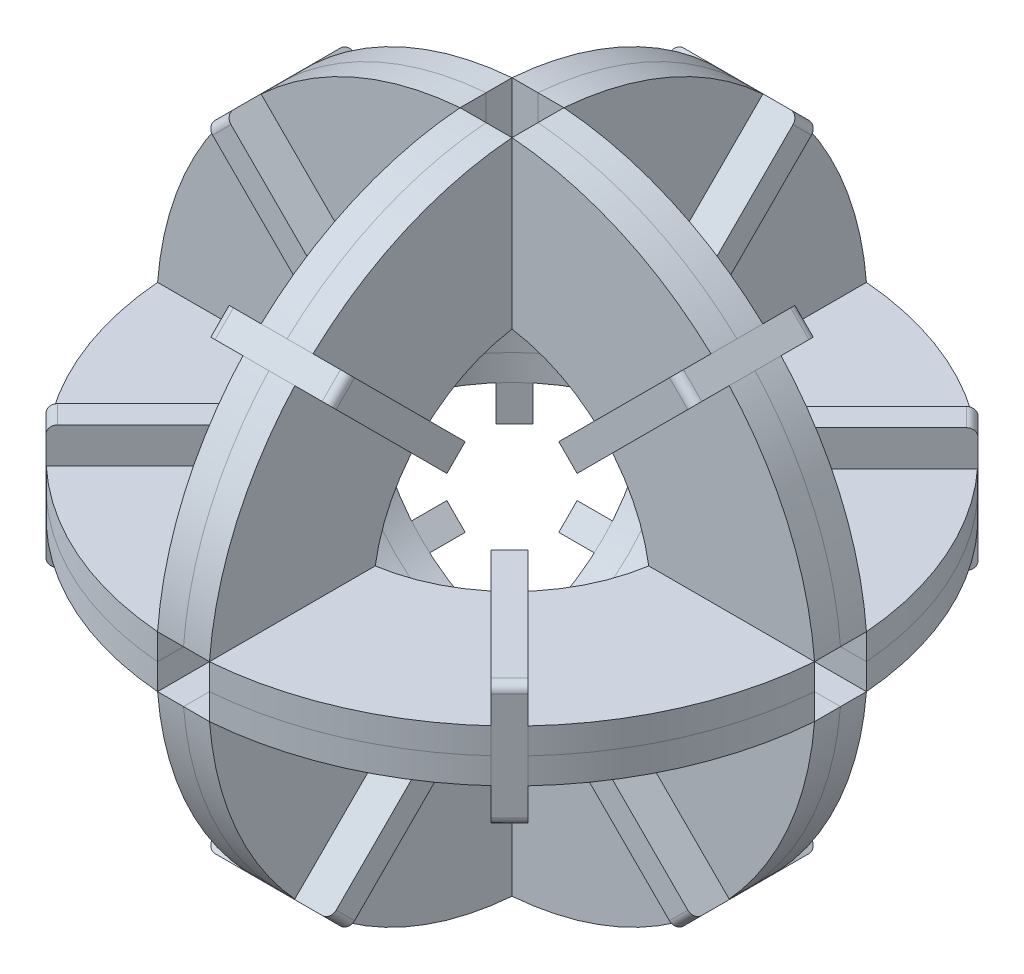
from build123d import *

# Parameters (mm, degrees)
BOSS_EXTRUDE2_DEPTH = 4.000000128
BOSS_EXTRUDE3_DEPTH = 4.000000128
BOSS_EXTRUDE1_DEPTH = 4.000000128
CUT_EXTRUDE1_DEPTH  = 86.468016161
CUT_EXTRUDE2_DEPTH  = 86.468016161
CUT_EXTRUDE3_DEPTH  = 86.468016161
CIRPATTERN2_COUNT   = 4
BOSS_EXTRUDE4_DEPTH = 4.000000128
BOSS_EXTRUDE5_DEPTH = 4.000000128
FILLET1_R           = 1.27
FILLET2_R           = 1.27
CIRPATTERN3_COUNT   = 4
FILLET3_R           = 1.27


with BuildPart() as part:
    # Sketch6 → Boss-Extrude2 (new body)
    with BuildSketch(Plane(origin=(0, 0, 0), x_dir=(0, 0, -1), z_dir=(1, 0, 0))):
        with BuildLine():
            Line((-4.000000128, 50.64227482), (-4.000000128, 25.083061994))
            ThreePointArc((-4.000000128, 25.083061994), (-17.960512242, 17.960512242), (-25.083061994, 4.000000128))
            Line((-25.083061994, 4.000000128), (-50.64227482, 4.000000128))
            ThreePointArc((-50.64227482, 4.000000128), (-35.921024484, 35.921024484), (-4.000000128, 50.64227482))
        make_face()
    extrude(amount=BOSS_EXTRUDE2_DEPTH)

    # Sketch8 → Cut-Extrude1 (cut, through all)
    with BuildSketch(Plane(origin=(4.000000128, 0, 0), x_dir=(0, 0, -1), z_dir=(1, 0, 0))):
        Polygon((-37.144319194, 34.697729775), (-34.697729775, 37.144319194), (-25.717473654, 28.164063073), (-28.164063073, 25.717473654), align=None)
    extrude(amount=-CUT_EXTRUDE1_DEPTH, mode=Mode.SUBTRACT)


with BuildPart() as body_2:
    # Sketch7 → Boss-Extrude3 (new body)
    with BuildSketch(Plane(origin=(0, 0, 0), x_dir=(1, 0, 0), z_dir=(0, 1, 0))):
        with BuildLine():
            Line((4.000000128, -25.083061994), (4.000000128, -50.64227482))
            ThreePointArc((4.000000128, -50.64227482), (35.921024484, -35.921024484), (50.64227482, -4.000000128))
            Line((50.64227482, -4.000000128), (25.083061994, -4.000000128))
            ThreePointArc((25.083061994, -4.000000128), (17.960512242, -17.960512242), (4.000000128, -25.083061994))
        make_face()
    extrude(amount=BOSS_EXTRUDE3_DEPTH)

    # Sketch10 → Cut-Extrude3 (cut, through all)
    with BuildSketch(Plane(origin=(0, 4.000000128, 0), x_dir=(1, 0, 0), z_dir=(0, 1, 0))):
        Polygon((37.144319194, -34.697729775), (34.697729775, -37.144319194), (25.717473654, -28.164063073), (28.164063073, -25.717473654), align=None)
    extrude(amount=-CUT_EXTRUDE3_DEPTH, mode=Mode.SUBTRACT)


with BuildPart() as body_3:
    # Sketch5 → Boss-Extrude1 (new body)
    with BuildSketch(Plane.XY):
        with BuildLine():
            Line((4.000000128, 50.64227482), (4.000000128, 25.083061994))
            ThreePointArc((4.000000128, 25.083061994), (17.960512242, 17.960512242), (25.083061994, 4.000000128))
            Line((25.083061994, 4.000000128), (50.64227482, 4.000000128))
            ThreePointArc((50.64227482, 4.000000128), (35.921024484, 35.921024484), (4.000000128, 50.64227482))
        make_face()
    extrude(amount=BOSS_EXTRUDE1_DEPTH)

    # Sketch9 → Cut-Extrude2 (cut, through all)
    with BuildSketch(Plane.XY.offset(4.000000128)):
        Polygon((34.697729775, 37.144319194), (37.144319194, 34.697729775), (28.164063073, 25.717473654), (25.717473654, 28.164063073), align=None)
    extrude(amount=-CUT_EXTRUDE2_DEPTH, mode=Mode.SUBTRACT)


with BuildPart() as cirpattern2_1:
    # CirPattern2: pattern copy
    add(body_2.part.rotate(Axis((0, 0, 0), (0, 1, 0)), 1 * 360 / CIRPATTERN2_COUNT))


with BuildPart() as cirpattern2_2:
    # CirPattern2: pattern copy
    add(body_2.part.rotate(Axis((0, 0, 0), (0, 1, 0)), 2 * 360 / CIRPATTERN2_COUNT))


with BuildPart() as cirpattern2_3:
    # CirPattern2: pattern copy
    add(body_2.part.rotate(Axis((0, 0, 0), (0, 1, 0)), 3 * 360 / CIRPATTERN2_COUNT))


with BuildPart() as cirpattern2_4:
    # CirPattern2: pattern copy
    add(body_3.part.rotate(Axis((0, 0, 0), (0, 1, 0)), 1 * 360 / CIRPATTERN2_COUNT))


with BuildPart() as cirpattern2_5:
    # CirPattern2: pattern copy
    add(body_3.part.rotate(Axis((0, 0, 0), (0, 1, 0)), 2 * 360 / CIRPATTERN2_COUNT))


with BuildPart() as cirpattern2_6:
    # CirPattern2: pattern copy
    add(body_3.part.rotate(Axis((0, 0, 0), (0, 1, 0)), 3 * 360 / CIRPATTERN2_COUNT))


with BuildPart() as cirpattern2_7:
    # CirPattern2: pattern copy
    add(part.part.rotate(Axis((0, 0, 0), (0, 1, 0)), 1 * 360 / CIRPATTERN2_COUNT))


with BuildPart() as cirpattern2_8:
    # CirPattern2: pattern copy
    add(part.part.rotate(Axis((0, 0, 0), (0, 1, 0)), 2 * 360 / CIRPATTERN2_COUNT))


with BuildPart() as cirpattern2_9:
    # CirPattern2: pattern copy
    add(part.part.rotate(Axis((0, 0, 0), (0, 1, 0)), 3 * 360 / CIRPATTERN2_COUNT))


with BuildPart() as body_13:
    # Mirror2: mirrored copy
    add(part.part.mirror(Plane.ZX))


with BuildPart() as body_14:
    # Mirror2 2: mirrored copy
    add(body_2.part.mirror(Plane.ZX))


with BuildPart() as body_15:
    # Mirror2 3: mirrored copy
    add(body_3.part.mirror(Plane.ZX))


with BuildPart() as body_16:
    # Mirror2 4: mirrored copy
    add(cirpattern2_1.part.mirror(Plane.ZX))


with BuildPart() as body_17:
    # Mirror2 5: mirrored copy
    add(cirpattern2_2.part.mirror(Plane.ZX))


with BuildPart() as body_18:
    # Mirror2 6: mirrored copy
    add(cirpattern2_3.part.mirror(Plane.ZX))


with BuildPart() as body_19:
    # Mirror2 7: mirrored copy
    add(cirpattern2_4.part.mirror(Plane.ZX))


with BuildPart() as body_20:
    # Mirror2 8: mirrored copy
    add(cirpattern2_5.part.mirror(Plane.ZX))


with BuildPart() as body_21:
    # Mirror2 9: mirrored copy
    add(cirpattern2_6.part.mirror(Plane.ZX))


with BuildPart() as body_22:
    # Mirror2 10: mirrored copy
    add(cirpattern2_7.part.mirror(Plane.ZX))


with BuildPart() as body_23:
    # Mirror2 11: mirrored copy
    add(cirpattern2_8.part.mirror(Plane.ZX))


with BuildPart() as body_24:
    # Mirror2 12: mirrored copy
    add(cirpattern2_9.part.mirror(Plane.ZX))


with BuildPart() as body_25:
    # Sketch11 → Boss-Extrude4 (new body)
    with BuildSketch(Plane(origin=(0, 1.22329471, -1.22329471), x_dir=(1, 0, 0), z_dir=(7.40655039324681e-15, -0.7071067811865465, 0.7071067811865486))):
        Polygon((-3.713999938, 38.1), (3.713999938, 38.1), (3.713999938, 25.4), (9.525, 25.4), (9.525, 50.8), (-9.525, 50.8), (-9.525, 25.4), (-3.713999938, 25.4), align=None)
    extrude(amount=BOSS_EXTRUDE4_DEPTH)

    # Fillet1
    fillet1_edges = [body_25.edges().sort_by_distance(p)[0] for p in [
        (9.525, 35.730105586, 36.111943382),
        (-9.525, 35.730105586, 36.111943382),
    ]]
    fillet(fillet1_edges, radius=FILLET1_R)


with BuildPart() as body_26:
    # Sketch13 → Boss-Extrude5 (new body)
    with BuildSketch(Plane(origin=(1.22329471, 0, -1.22329471), x_dir=(0.7071067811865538, 0, 0.7071067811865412), z_dir=(-0.7071067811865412, 0, 0.7071067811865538))):
        Polygon((38.1, 3.459999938), (38.1, -3.459999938), (25.4, -3.459999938), (25.4, -9.525), (50.8, -9.525), (50.8, 9.525), (25.4, 9.525), (25.4, 3.459999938), align=None)
    extrude(amount=BOSS_EXTRUDE5_DEPTH)

    # Fillet2
    fillet2_edges = [body_26.edges().sort_by_distance(p)[0] for p in [
        (35.730105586, 9.525, 36.111943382),
        (35.730105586, -9.525, 36.111943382),
    ]]
    fillet(fillet2_edges, radius=FILLET2_R)


with BuildPart() as cirpattern3_1:
    # CirPattern3: pattern copy
    add(body_26.part.rotate(Axis((0, 0, 0), (0, 1, 0)), 1 * 360 / CIRPATTERN3_COUNT))


with BuildPart() as cirpattern3_2:
    # CirPattern3: pattern copy
    add(body_26.part.rotate(Axis((0, 0, 0), (0, 1, 0)), 2 * 360 / CIRPATTERN3_COUNT))


with BuildPart() as cirpattern3_3:
    # CirPattern3: pattern copy
    add(body_26.part.rotate(Axis((0, 0, 0), (0, 1, 0)), 3 * 360 / CIRPATTERN3_COUNT))


with BuildPart() as cirpattern3_4:
    # CirPattern3: pattern copy
    add(body_25.part.rotate(Axis((0, 0, 0), (0, 1, 0)), 1 * 360 / CIRPATTERN3_COUNT))


with BuildPart() as cirpattern3_5:
    # CirPattern3: pattern copy
    add(body_25.part.rotate(Axis((0, 0, 0), (0, 1, 0)), 2 * 360 / CIRPATTERN3_COUNT))


with BuildPart() as cirpattern3_6:
    # CirPattern3: pattern copy
    add(body_25.part.rotate(Axis((0, 0, 0), (0, 1, 0)), 3 * 360 / CIRPATTERN3_COUNT))


with BuildPart() as body_33:
    # Mirror4: mirrored copy
    add(cirpattern3_6.part.mirror(Plane.ZX))


with BuildPart() as body_34:
    # Mirror4 2: mirrored copy
    add(body_25.part.mirror(Plane.ZX))


with BuildPart() as body_35:
    # Mirror4 3: mirrored copy
    add(cirpattern3_5.part.mirror(Plane.ZX))


with BuildPart() as body_36:
    # Mirror4 4: mirrored copy
    add(cirpattern3_4.part.mirror(Plane.ZX))


with BuildPart() as body_25_1:
    add(body_25.part)

    # Fillet3
    fillet3_edges = [body_25_1.edges().sort_by_distance(p)[0] for p in [
        (3.713999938, 17.769593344, 18.15143114),
        (-3.713999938, 17.769593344, 18.15143114),
    ]]
    fillet(fillet3_edges, radius=FILLET3_R)


solid = Compound([part.part, body_2.part, body_3.part, cirpattern2_1.part, cirpattern2_2.part, cirpattern2_3.part, cirpattern2_4.part, cirpattern2_5.part, cirpattern2_6.part, cirpattern2_7.part, cirpattern2_8.part, cirpattern2_9.part, body_13.part, body_14.part, body_15.part, body_16.part, body_17.part, body_18.part, body_19.part, body_20.part, body_21.part, body_22.part, body_23.part, body_24.part, body_26.part, cirpattern3_1.part, cirpattern3_2.part, cirpattern3_3.part, cirpattern3_4.part, cirpattern3_5.part, cirpattern3_6.part, body_33.part, body_34.part, body_35.part, body_36.part, body_25_1.part])
